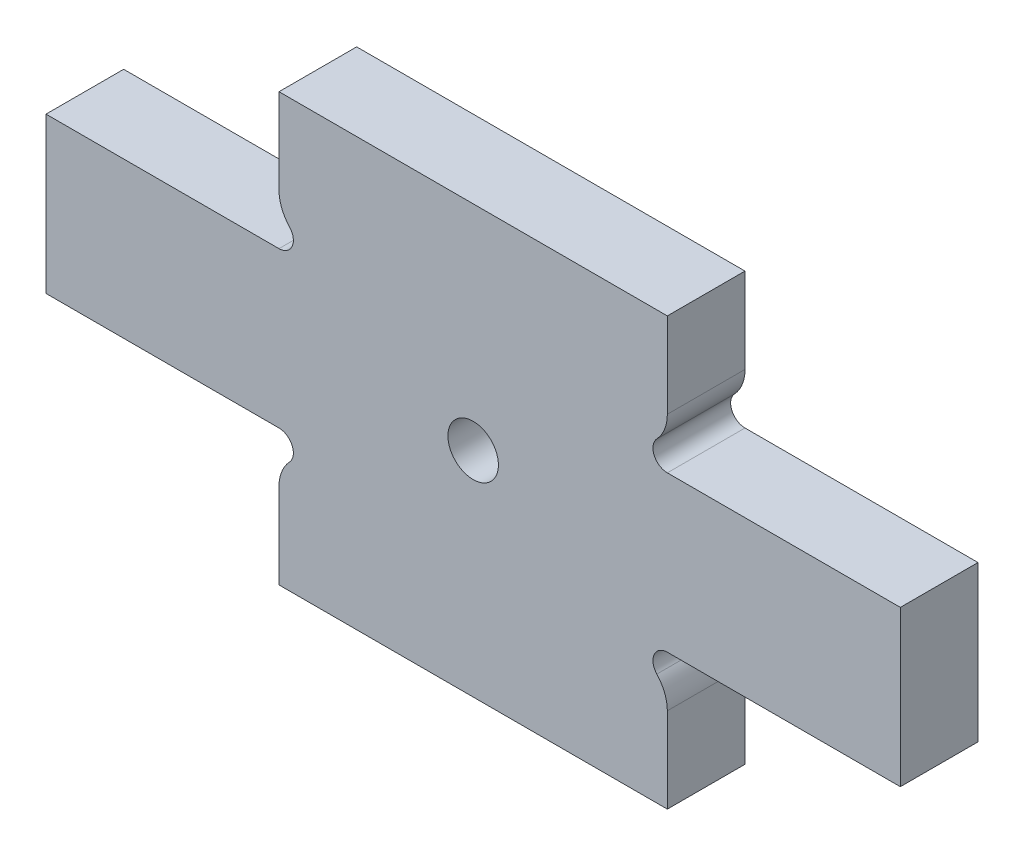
ISO-10303-21;
HEADER;
FILE_DESCRIPTION(('STEP AP214'),'2;1');
FILE_NAME('part.step','',(''),(''),'','','');
FILE_SCHEMA(('AUTOMOTIVE_DESIGN { 1 0 10303 214 1 1 1 1 }'));
ENDSEC;
DATA;
#1=APPLICATION_CONTEXT('core data for automotive mechanical design processes');
#2=APPLICATION_PROTOCOL_DEFINITION('international standard','automotive_design',2000,#1);
#3=PRODUCT_CONTEXT('',#1,'mechanical');
#4=PRODUCT('Part','Part','',(#3));
#5=PRODUCT_RELATED_PRODUCT_CATEGORY('part','',(#4));
#6=PRODUCT_DEFINITION_FORMATION('','',#4);
#7=PRODUCT_DEFINITION_CONTEXT('part definition',#1,'design');
#8=PRODUCT_DEFINITION('design','',#6,#7);
#9=PRODUCT_DEFINITION_SHAPE('','',#8);
#10=(LENGTH_UNIT() NAMED_UNIT(*) SI_UNIT(.MILLI.,.METRE.));
#11=(NAMED_UNIT(*) PLANE_ANGLE_UNIT() SI_UNIT($,.RADIAN.));
#12=(NAMED_UNIT(*) SI_UNIT($,.STERADIAN.) SOLID_ANGLE_UNIT());
#13=UNCERTAINTY_MEASURE_WITH_UNIT(LENGTH_MEASURE(1.E-05),#10,'distance_accuracy_value','');
#14=(GEOMETRIC_REPRESENTATION_CONTEXT(3) GLOBAL_UNCERTAINTY_ASSIGNED_CONTEXT((#13)) GLOBAL_UNIT_ASSIGNED_CONTEXT((#10,
#11,#12)) REPRESENTATION_CONTEXT('',''));
#15=CARTESIAN_POINT('',(0.,0.,0.));
#16=DIRECTION('',(0.,0.,1.));
#17=DIRECTION('',(1.,0.,0.));
#18=AXIS2_PLACEMENT_3D('',#15,#16,#17);
#19=CARTESIAN_POINT('',(20.0000000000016,-16.5321469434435,10.));
#20=DIRECTION('',(0.,0.,-1.));
#21=DIRECTION('',(-1.,0.,0.));
#22=AXIS2_PLACEMENT_3D('',#19,#20,#21);
#23=CYLINDRICAL_SURFACE('',#22,4.99999999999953);
#24=CARTESIAN_POINT('',(20.0000000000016,-16.5321469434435,0.));
#25=DIRECTION('',(0.,0.,1.));
#26=DIRECTION('',(1.,0.,0.));
#27=AXIS2_PLACEMENT_3D('',#24,#25,#26);
#28=CIRCLE('',#27,4.99999999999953);
#29=CARTESIAN_POINT('',(25.0000000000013,-16.5321469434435,0.));
#30=VERTEX_POINT('',#29);
#31=CARTESIAN_POINT('',(23.6496350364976,-13.1145214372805,0.));
#32=VERTEX_POINT('',#31);
#33=EDGE_CURVE('E210',#30,#32,#28,.T.);
#34=ORIENTED_EDGE('',*,*,#33,.T.);
#35=DIRECTION('',(0.,0.,-1.));
#36=VECTOR('',#35,1.);
#37=CARTESIAN_POINT('',(23.6496350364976,-13.1145214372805,10.));
#38=LINE('',#37,#36);
#39=CARTESIAN_POINT('',(23.6496350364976,-13.1145214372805,10.));
#40=VERTEX_POINT('',#39);
#41=EDGE_CURVE('E11',#40,#32,#38,.T.);
#42=ORIENTED_EDGE('',*,*,#41,.F.);
#43=CARTESIAN_POINT('',(20.0000000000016,-16.5321469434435,10.));
#44=DIRECTION('',(0.,0.,1.));
#45=DIRECTION('',(1.,0.,0.));
#46=AXIS2_PLACEMENT_3D('',#43,#44,#45);
#47=CIRCLE('',#46,4.99999999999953);
#48=CARTESIAN_POINT('',(25.0000000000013,-16.5321469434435,10.));
#49=VERTEX_POINT('',#48);
#50=EDGE_CURVE('E249',#49,#40,#47,.T.);
#51=ORIENTED_EDGE('',*,*,#50,.F.);
#52=DIRECTION('',(0.,0.,-1.));
#53=VECTOR('',#52,1.);
#54=CARTESIAN_POINT('',(25.0000000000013,-16.5321469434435,10.));
#55=LINE('',#54,#53);
#56=EDGE_CURVE('E206',#49,#30,#55,.T.);
#57=ORIENTED_EDGE('',*,*,#56,.T.);
#58=EDGE_LOOP('',(#34,#42,#51,#57));
#59=FACE_BOUND('',#58,.T.);
#60=ADVANCED_FACE('F42',(#59),#23,.T.);
#61=CARTESIAN_POINT('',(25.0000000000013,-11.85,10.));
#62=DIRECTION('',(0.,0.,-1.));
#63=DIRECTION('',(-1.,0.,0.));
#64=AXIS2_PLACEMENT_3D('',#61,#62,#63);
#65=CYLINDRICAL_SURFACE('',#64,1.85000000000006);
#66=CARTESIAN_POINT('',(25.0000000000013,-11.85,0.));
#67=DIRECTION('',(0.,0.,-1.));
#68=DIRECTION('',(1.,0.,0.));
#69=AXIS2_PLACEMENT_3D('',#66,#67,#68);
#70=CIRCLE('',#69,1.85000000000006);
#71=CARTESIAN_POINT('',(25.0000000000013,-9.99999999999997,0.));
#72=VERTEX_POINT('',#71);
#73=EDGE_CURVE('E213',#32,#72,#70,.T.);
#74=ORIENTED_EDGE('',*,*,#73,.T.);
#75=DIRECTION('',(0.,0.,-1.));
#76=VECTOR('',#75,1.);
#77=CARTESIAN_POINT('',(25.0000000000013,-9.99999999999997,10.));
#78=LINE('',#77,#76);
#79=CARTESIAN_POINT('',(25.0000000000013,-9.99999999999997,10.));
#80=VERTEX_POINT('',#79);
#81=EDGE_CURVE('E50',#80,#72,#78,.T.);
#82=ORIENTED_EDGE('',*,*,#81,.F.);
#83=CARTESIAN_POINT('',(25.0000000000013,-11.85,10.));
#84=DIRECTION('',(0.,0.,-1.));
#85=DIRECTION('',(1.,0.,0.));
#86=AXIS2_PLACEMENT_3D('',#83,#84,#85);
#87=CIRCLE('',#86,1.85000000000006);
#88=EDGE_CURVE('E137',#40,#80,#87,.T.);
#89=ORIENTED_EDGE('',*,*,#88,.F.);
#90=ORIENTED_EDGE('',*,*,#41,.T.);
#91=EDGE_LOOP('',(#74,#82,#89,#90));
#92=FACE_BOUND('',#91,.T.);
#93=ADVANCED_FACE('F368',(#92),#65,.F.);
#94=CARTESIAN_POINT('',(25.0000000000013,-9.99999999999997,10.));
#95=DIRECTION('',(0.,1.,0.));
#96=DIRECTION('',(-1.,0.,0.));
#97=AXIS2_PLACEMENT_3D('',#94,#95,#96);
#98=PLANE('',#97);
#99=DIRECTION('',(1.,0.,0.));
#100=VECTOR('',#99,1.);
#101=CARTESIAN_POINT('',(25.0000000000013,-9.99999999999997,0.));
#102=LINE('',#101,#100);
#103=CARTESIAN_POINT('',(55.0000000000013,-9.99999999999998,0.));
#104=VERTEX_POINT('',#103);
#105=EDGE_CURVE('E216',#72,#104,#102,.T.);
#106=ORIENTED_EDGE('',*,*,#105,.T.);
#107=DIRECTION('',(0.,0.,-1.));
#108=VECTOR('',#107,1.);
#109=CARTESIAN_POINT('',(55.0000000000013,-9.99999999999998,10.));
#110=LINE('',#109,#108);
#111=CARTESIAN_POINT('',(55.0000000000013,-9.99999999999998,10.));
#112=VERTEX_POINT('',#111);
#113=EDGE_CURVE('E292',#112,#104,#110,.T.);
#114=ORIENTED_EDGE('',*,*,#113,.F.);
#115=DIRECTION('',(1.,0.,0.));
#116=VECTOR('',#115,1.);
#117=CARTESIAN_POINT('',(25.0000000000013,-9.99999999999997,10.));
#118=LINE('',#117,#116);
#119=EDGE_CURVE('E300',#80,#112,#118,.T.);
#120=ORIENTED_EDGE('',*,*,#119,.F.);
#121=ORIENTED_EDGE('',*,*,#81,.T.);
#122=EDGE_LOOP('',(#106,#114,#120,#121));
#123=FACE_BOUND('',#122,.T.);
#124=ADVANCED_FACE('F298',(#123),#98,.F.);
#125=CARTESIAN_POINT('',(55.0000000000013,-9.99999999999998,10.));
#126=DIRECTION('',(-1.,0.,0.));
#127=DIRECTION('',(0.,-1.,0.));
#128=AXIS2_PLACEMENT_3D('',#125,#126,#127);
#129=PLANE('',#128);
#130=DIRECTION('',(0.,1.,0.));
#131=VECTOR('',#130,1.);
#132=CARTESIAN_POINT('',(55.0000000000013,-9.99999999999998,0.));
#133=LINE('',#132,#131);
#134=CARTESIAN_POINT('',(55.0000000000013,10.,0.));
#135=VERTEX_POINT('',#134);
#136=EDGE_CURVE('E218',#104,#135,#133,.T.);
#137=ORIENTED_EDGE('',*,*,#136,.T.);
#138=DIRECTION('',(0.,0.,-1.));
#139=VECTOR('',#138,1.);
#140=CARTESIAN_POINT('',(55.0000000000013,10.,10.));
#141=LINE('',#140,#139);
#142=CARTESIAN_POINT('',(55.0000000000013,10.,10.));
#143=VERTEX_POINT('',#142);
#144=EDGE_CURVE('E289',#143,#135,#141,.T.);
#145=ORIENTED_EDGE('',*,*,#144,.F.);
#146=DIRECTION('',(0.,1.,0.));
#147=VECTOR('',#146,1.);
#148=CARTESIAN_POINT('',(55.0000000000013,-9.99999999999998,10.));
#149=LINE('',#148,#147);
#150=EDGE_CURVE('E318',#112,#143,#149,.T.);
#151=ORIENTED_EDGE('',*,*,#150,.F.);
#152=ORIENTED_EDGE('',*,*,#113,.T.);
#153=EDGE_LOOP('',(#137,#145,#151,#152));
#154=FACE_BOUND('',#153,.T.);
#155=ADVANCED_FACE('F309',(#154),#129,.F.);
#156=CARTESIAN_POINT('',(55.0000000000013,10.,10.));
#157=DIRECTION('',(0.,-1.,0.));
#158=DIRECTION('',(1.,0.,0.));
#159=AXIS2_PLACEMENT_3D('',#156,#157,#158);
#160=PLANE('',#159);
#161=DIRECTION('',(-1.,0.,0.));
#162=VECTOR('',#161,1.);
#163=CARTESIAN_POINT('',(55.0000000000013,10.,0.));
#164=LINE('',#163,#162);
#165=CARTESIAN_POINT('',(25.0000000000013,9.99999999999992,0.));
#166=VERTEX_POINT('',#165);
#167=EDGE_CURVE('E220',#135,#166,#164,.T.);
#168=ORIENTED_EDGE('',*,*,#167,.T.);
#169=DIRECTION('',(0.,0.,-1.));
#170=VECTOR('',#169,1.);
#171=CARTESIAN_POINT('',(25.0000000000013,9.99999999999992,10.));
#172=LINE('',#171,#170);
#173=CARTESIAN_POINT('',(25.0000000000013,9.99999999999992,10.));
#174=VERTEX_POINT('',#173);
#175=EDGE_CURVE('E286',#174,#166,#172,.T.);
#176=ORIENTED_EDGE('',*,*,#175,.F.);
#177=DIRECTION('',(-1.,0.,0.));
#178=VECTOR('',#177,1.);
#179=CARTESIAN_POINT('',(55.0000000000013,10.,10.));
#180=LINE('',#179,#178);
#181=EDGE_CURVE('E315',#143,#174,#180,.T.);
#182=ORIENTED_EDGE('',*,*,#181,.F.);
#183=ORIENTED_EDGE('',*,*,#144,.T.);
#184=EDGE_LOOP('',(#168,#176,#182,#183));
#185=FACE_BOUND('',#184,.T.);
#186=ADVANCED_FACE('F313',(#185),#160,.F.);
#187=CARTESIAN_POINT('',(25.0000000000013,11.85,10.));
#188=DIRECTION('',(0.,0.,-1.));
#189=DIRECTION('',(-1.,0.,0.));
#190=AXIS2_PLACEMENT_3D('',#187,#188,#189);
#191=CYLINDRICAL_SURFACE('',#190,1.85000000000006);
#192=CARTESIAN_POINT('',(25.0000000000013,11.85,0.));
#193=DIRECTION('',(0.,0.,-1.));
#194=DIRECTION('',(1.,0.,0.));
#195=AXIS2_PLACEMENT_3D('',#192,#193,#194);
#196=CIRCLE('',#195,1.85000000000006);
#197=CARTESIAN_POINT('',(23.6496350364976,13.1145214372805,0.));
#198=VERTEX_POINT('',#197);
#199=EDGE_CURVE('E222',#166,#198,#196,.T.);
#200=ORIENTED_EDGE('',*,*,#199,.T.);
#201=DIRECTION('',(0.,0.,-1.));
#202=VECTOR('',#201,1.);
#203=CARTESIAN_POINT('',(23.6496350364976,13.1145214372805,10.));
#204=LINE('',#203,#202);
#205=CARTESIAN_POINT('',(23.6496350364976,13.1145214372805,10.));
#206=VERTEX_POINT('',#205);
#207=EDGE_CURVE('E283',#206,#198,#204,.T.);
#208=ORIENTED_EDGE('',*,*,#207,.F.);
#209=CARTESIAN_POINT('',(25.0000000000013,11.85,10.));
#210=DIRECTION('',(0.,0.,-1.));
#211=DIRECTION('',(1.,0.,0.));
#212=AXIS2_PLACEMENT_3D('',#209,#210,#211);
#213=CIRCLE('',#212,1.85000000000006);
#214=EDGE_CURVE('E317',#174,#206,#213,.T.);
#215=ORIENTED_EDGE('',*,*,#214,.F.);
#216=ORIENTED_EDGE('',*,*,#175,.T.);
#217=EDGE_LOOP('',(#200,#208,#215,#216));
#218=FACE_BOUND('',#217,.T.);
#219=ADVANCED_FACE('F381',(#218),#191,.F.);
#220=CARTESIAN_POINT('',(20.0000000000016,16.5321469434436,10.));
#221=DIRECTION('',(0.,0.,-1.));
#222=DIRECTION('',(-1.,0.,0.));
#223=AXIS2_PLACEMENT_3D('',#220,#221,#222);
#224=CYLINDRICAL_SURFACE('',#223,4.99999999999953);
#225=CARTESIAN_POINT('',(20.0000000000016,16.5321469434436,0.));
#226=DIRECTION('',(0.,0.,1.));
#227=DIRECTION('',(1.,0.,0.));
#228=AXIS2_PLACEMENT_3D('',#225,#226,#227);
#229=CIRCLE('',#228,4.99999999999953);
#230=CARTESIAN_POINT('',(25.0000000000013,16.5321469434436,0.));
#231=VERTEX_POINT('',#230);
#232=EDGE_CURVE('E224',#198,#231,#229,.T.);
#233=ORIENTED_EDGE('',*,*,#232,.T.);
#234=DIRECTION('',(0.,0.,-1.));
#235=VECTOR('',#234,1.);
#236=CARTESIAN_POINT('',(25.0000000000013,16.5321469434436,10.));
#237=LINE('',#236,#235);
#238=CARTESIAN_POINT('',(25.0000000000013,16.5321469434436,10.));
#239=VERTEX_POINT('',#238);
#240=EDGE_CURVE('E280',#239,#231,#237,.T.);
#241=ORIENTED_EDGE('',*,*,#240,.F.);
#242=CARTESIAN_POINT('',(20.0000000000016,16.5321469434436,10.));
#243=DIRECTION('',(0.,0.,1.));
#244=DIRECTION('',(1.,0.,0.));
#245=AXIS2_PLACEMENT_3D('',#242,#243,#244);
#246=CIRCLE('',#245,4.99999999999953);
#247=EDGE_CURVE('E320',#206,#239,#246,.T.);
#248=ORIENTED_EDGE('',*,*,#247,.F.);
#249=ORIENTED_EDGE('',*,*,#207,.T.);
#250=EDGE_LOOP('',(#233,#241,#248,#249));
#251=FACE_BOUND('',#250,.T.);
#252=ADVANCED_FACE('F384',(#251),#224,.T.);
#253=CARTESIAN_POINT('',(25.0000000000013,16.5321469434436,10.));
#254=DIRECTION('',(-1.,0.,0.));
#255=DIRECTION('',(0.,0.,1.));
#256=AXIS2_PLACEMENT_3D('',#253,#254,#255);
#257=PLANE('',#256);
#258=DIRECTION('',(0.,1.,0.));
#259=VECTOR('',#258,1.);
#260=CARTESIAN_POINT('',(25.0000000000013,16.5321469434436,0.));
#261=LINE('',#260,#259);
#262=CARTESIAN_POINT('',(25.0000000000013,27.5,0.));
#263=VERTEX_POINT('',#262);
#264=EDGE_CURVE('E226',#231,#263,#261,.T.);
#265=ORIENTED_EDGE('',*,*,#264,.T.);
#266=DIRECTION('',(0.,0.,-1.));
#267=VECTOR('',#266,1.);
#268=CARTESIAN_POINT('',(25.0000000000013,27.5,10.));
#269=LINE('',#268,#267);
#270=CARTESIAN_POINT('',(25.0000000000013,27.5,10.));
#271=VERTEX_POINT('',#270);
#272=EDGE_CURVE('E277',#271,#263,#269,.T.);
#273=ORIENTED_EDGE('',*,*,#272,.F.);
#274=DIRECTION('',(0.,1.,0.));
#275=VECTOR('',#274,1.);
#276=CARTESIAN_POINT('',(25.0000000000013,16.5321469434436,10.));
#277=LINE('',#276,#275);
#278=EDGE_CURVE('E326',#239,#271,#277,.T.);
#279=ORIENTED_EDGE('',*,*,#278,.F.);
#280=ORIENTED_EDGE('',*,*,#240,.T.);
#281=EDGE_LOOP('',(#265,#273,#279,#280));
#282=FACE_BOUND('',#281,.T.);
#283=ADVANCED_FACE('F388',(#282),#257,.F.);
#284=CARTESIAN_POINT('',(25.0000000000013,27.5,10.));
#285=DIRECTION('',(0.,-1.,0.));
#286=DIRECTION('',(0.,0.,-1.));
#287=AXIS2_PLACEMENT_3D('',#284,#285,#286);
#288=PLANE('',#287);
#289=DIRECTION('',(-1.,0.,0.));
#290=VECTOR('',#289,1.);
#291=CARTESIAN_POINT('',(25.0000000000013,27.5,0.));
#292=LINE('',#291,#290);
#293=CARTESIAN_POINT('',(-25.,27.5,0.));
#294=VERTEX_POINT('',#293);
#295=EDGE_CURVE('E228',#263,#294,#292,.T.);
#296=ORIENTED_EDGE('',*,*,#295,.T.);
#297=DIRECTION('',(0.,0.,-1.));
#298=VECTOR('',#297,1.);
#299=CARTESIAN_POINT('',(-25.,27.5,10.));
#300=LINE('',#299,#298);
#301=CARTESIAN_POINT('',(-25.,27.5,10.));
#302=VERTEX_POINT('',#301);
#303=EDGE_CURVE('E274',#302,#294,#300,.T.);
#304=ORIENTED_EDGE('',*,*,#303,.F.);
#305=DIRECTION('',(-1.,0.,0.));
#306=VECTOR('',#305,1.);
#307=CARTESIAN_POINT('',(25.0000000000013,27.5,10.));
#308=LINE('',#307,#306);
#309=EDGE_CURVE('E328',#271,#302,#308,.T.);
#310=ORIENTED_EDGE('',*,*,#309,.F.);
#311=ORIENTED_EDGE('',*,*,#272,.T.);
#312=EDGE_LOOP('',(#296,#304,#310,#311));
#313=FACE_BOUND('',#312,.T.);
#314=ADVANCED_FACE('F392',(#313),#288,.F.);
#315=CARTESIAN_POINT('',(-25.,27.5,10.));
#316=DIRECTION('',(1.,0.,0.));
#317=DIRECTION('',(0.,0.,-1.));
#318=AXIS2_PLACEMENT_3D('',#315,#316,#317);
#319=PLANE('',#318);
#320=DIRECTION('',(0.,-1.,0.));
#321=VECTOR('',#320,1.);
#322=CARTESIAN_POINT('',(-25.,27.5,0.));
#323=LINE('',#322,#321);
#324=CARTESIAN_POINT('',(-24.9999999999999,16.5321469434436,0.));
#325=VERTEX_POINT('',#324);
#326=EDGE_CURVE('E230',#294,#325,#323,.T.);
#327=ORIENTED_EDGE('',*,*,#326,.T.);
#328=DIRECTION('',(0.,0.,-1.));
#329=VECTOR('',#328,1.);
#330=CARTESIAN_POINT('',(-24.9999999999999,16.5321469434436,10.));
#331=LINE('',#330,#329);
#332=CARTESIAN_POINT('',(-24.9999999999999,16.5321469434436,10.));
#333=VERTEX_POINT('',#332);
#334=EDGE_CURVE('E271',#333,#325,#331,.T.);
#335=ORIENTED_EDGE('',*,*,#334,.F.);
#336=DIRECTION('',(0.,-1.,0.));
#337=VECTOR('',#336,1.);
#338=CARTESIAN_POINT('',(-25.,27.5,10.));
#339=LINE('',#338,#337);
#340=EDGE_CURVE('E330',#302,#333,#339,.T.);
#341=ORIENTED_EDGE('',*,*,#340,.F.);
#342=ORIENTED_EDGE('',*,*,#303,.T.);
#343=EDGE_LOOP('',(#327,#335,#341,#342));
#344=FACE_BOUND('',#343,.T.);
#345=ADVANCED_FACE('F396',(#344),#319,.F.);
#346=CARTESIAN_POINT('',(-20.0000000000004,16.5321469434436,10.));
#347=DIRECTION('',(0.,0.,-1.));
#348=DIRECTION('',(-1.,0.,0.));
#349=AXIS2_PLACEMENT_3D('',#346,#347,#348);
#350=CYLINDRICAL_SURFACE('',#349,4.99999999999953);
#351=CARTESIAN_POINT('',(-20.0000000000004,16.5321469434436,0.));
#352=DIRECTION('',(0.,0.,1.));
#353=DIRECTION('',(1.,0.,0.));
#354=AXIS2_PLACEMENT_3D('',#351,#352,#353);
#355=CIRCLE('',#354,4.99999999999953);
#356=CARTESIAN_POINT('',(-23.6496350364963,13.1145214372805,0.));
#357=VERTEX_POINT('',#356);
#358=EDGE_CURVE('E232',#325,#357,#355,.T.);
#359=ORIENTED_EDGE('',*,*,#358,.T.);
#360=DIRECTION('',(0.,0.,-1.));
#361=VECTOR('',#360,1.);
#362=CARTESIAN_POINT('',(-23.6496350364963,13.1145214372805,10.));
#363=LINE('',#362,#361);
#364=CARTESIAN_POINT('',(-23.6496350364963,13.1145214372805,10.));
#365=VERTEX_POINT('',#364);
#366=EDGE_CURVE('E268',#365,#357,#363,.T.);
#367=ORIENTED_EDGE('',*,*,#366,.F.);
#368=CARTESIAN_POINT('',(-20.0000000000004,16.5321469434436,10.));
#369=DIRECTION('',(0.,0.,1.));
#370=DIRECTION('',(1.,0.,0.));
#371=AXIS2_PLACEMENT_3D('',#368,#369,#370);
#372=CIRCLE('',#371,4.99999999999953);
#373=EDGE_CURVE('E332',#333,#365,#372,.T.);
#374=ORIENTED_EDGE('',*,*,#373,.F.);
#375=ORIENTED_EDGE('',*,*,#334,.T.);
#376=EDGE_LOOP('',(#359,#367,#374,#375));
#377=FACE_BOUND('',#376,.T.);
#378=ADVANCED_FACE('F400',(#377),#350,.T.);
#379=CARTESIAN_POINT('',(-25.,11.85,10.));
#380=DIRECTION('',(0.,0.,-1.));
#381=DIRECTION('',(-1.,0.,0.));
#382=AXIS2_PLACEMENT_3D('',#379,#380,#381);
#383=CYLINDRICAL_SURFACE('',#382,1.85000000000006);
#384=CARTESIAN_POINT('',(-25.,11.85,0.));
#385=DIRECTION('',(0.,0.,-1.));
#386=DIRECTION('',(1.,0.,0.));
#387=AXIS2_PLACEMENT_3D('',#384,#385,#386);
#388=CIRCLE('',#387,1.85000000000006);
#389=CARTESIAN_POINT('',(-25.,10.,0.));
#390=VERTEX_POINT('',#389);
#391=EDGE_CURVE('E234',#357,#390,#388,.T.);
#392=ORIENTED_EDGE('',*,*,#391,.T.);
#393=DIRECTION('',(0.,0.,-1.));
#394=VECTOR('',#393,1.);
#395=CARTESIAN_POINT('',(-25.,10.,10.));
#396=LINE('',#395,#394);
#397=CARTESIAN_POINT('',(-25.,10.,10.));
#398=VERTEX_POINT('',#397);
#399=EDGE_CURVE('E265',#398,#390,#396,.T.);
#400=ORIENTED_EDGE('',*,*,#399,.F.);
#401=CARTESIAN_POINT('',(-25.,11.85,10.));
#402=DIRECTION('',(0.,0.,-1.));
#403=DIRECTION('',(1.,0.,0.));
#404=AXIS2_PLACEMENT_3D('',#401,#402,#403);
#405=CIRCLE('',#404,1.85000000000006);
#406=EDGE_CURVE('E334',#365,#398,#405,.T.);
#407=ORIENTED_EDGE('',*,*,#406,.F.);
#408=ORIENTED_EDGE('',*,*,#366,.T.);
#409=EDGE_LOOP('',(#392,#400,#407,#408));
#410=FACE_BOUND('',#409,.T.);
#411=ADVANCED_FACE('F404',(#410),#383,.F.);
#412=CARTESIAN_POINT('',(-25.,10.,10.));
#413=DIRECTION('',(0.,-1.,0.));
#414=DIRECTION('',(1.,0.,0.));
#415=AXIS2_PLACEMENT_3D('',#412,#413,#414);
#416=PLANE('',#415);
#417=DIRECTION('',(-1.,0.,0.));
#418=VECTOR('',#417,1.);
#419=CARTESIAN_POINT('',(-25.,10.,0.));
#420=LINE('',#419,#418);
#421=CARTESIAN_POINT('',(-55.,10.,0.));
#422=VERTEX_POINT('',#421);
#423=EDGE_CURVE('E236',#390,#422,#420,.T.);
#424=ORIENTED_EDGE('',*,*,#423,.T.);
#425=DIRECTION('',(0.,0.,-1.));
#426=VECTOR('',#425,1.);
#427=CARTESIAN_POINT('',(-55.,10.,10.));
#428=LINE('',#427,#426);
#429=CARTESIAN_POINT('',(-55.,10.,10.));
#430=VERTEX_POINT('',#429);
#431=EDGE_CURVE('E262',#430,#422,#428,.T.);
#432=ORIENTED_EDGE('',*,*,#431,.F.);
#433=DIRECTION('',(-1.,0.,0.));
#434=VECTOR('',#433,1.);
#435=CARTESIAN_POINT('',(-25.,10.,10.));
#436=LINE('',#435,#434);
#437=EDGE_CURVE('E336',#398,#430,#436,.T.);
#438=ORIENTED_EDGE('',*,*,#437,.F.);
#439=ORIENTED_EDGE('',*,*,#399,.T.);
#440=EDGE_LOOP('',(#424,#432,#438,#439));
#441=FACE_BOUND('',#440,.T.);
#442=ADVANCED_FACE('F408',(#441),#416,.F.);
#443=CARTESIAN_POINT('',(-55.,10.,10.));
#444=DIRECTION('',(1.,0.,0.));
#445=DIRECTION('',(0.,0.,-1.));
#446=AXIS2_PLACEMENT_3D('',#443,#444,#445);
#447=PLANE('',#446);
#448=DIRECTION('',(0.,-1.,0.));
#449=VECTOR('',#448,1.);
#450=CARTESIAN_POINT('',(-55.,10.,0.));
#451=LINE('',#450,#449);
#452=CARTESIAN_POINT('',(-55.,-9.99999999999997,0.));
#453=VERTEX_POINT('',#452);
#454=EDGE_CURVE('E238',#422,#453,#451,.T.);
#455=ORIENTED_EDGE('',*,*,#454,.T.);
#456=DIRECTION('',(0.,0.,-1.));
#457=VECTOR('',#456,1.);
#458=CARTESIAN_POINT('',(-55.,-9.99999999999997,10.));
#459=LINE('',#458,#457);
#460=CARTESIAN_POINT('',(-55.,-9.99999999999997,10.));
#461=VERTEX_POINT('',#460);
#462=EDGE_CURVE('E259',#461,#453,#459,.T.);
#463=ORIENTED_EDGE('',*,*,#462,.F.);
#464=DIRECTION('',(0.,-1.,0.));
#465=VECTOR('',#464,1.);
#466=CARTESIAN_POINT('',(-55.,10.,10.));
#467=LINE('',#466,#465);
#468=EDGE_CURVE('E338',#430,#461,#467,.T.);
#469=ORIENTED_EDGE('',*,*,#468,.F.);
#470=ORIENTED_EDGE('',*,*,#431,.T.);
#471=EDGE_LOOP('',(#455,#463,#469,#470));
#472=FACE_BOUND('',#471,.T.);
#473=ADVANCED_FACE('F412',(#472),#447,.F.);
#474=CARTESIAN_POINT('',(-55.,-9.99999999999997,10.));
#475=DIRECTION('',(0.,1.,0.));
#476=DIRECTION('',(0.,0.,1.));
#477=AXIS2_PLACEMENT_3D('',#474,#475,#476);
#478=PLANE('',#477);
#479=DIRECTION('',(1.,0.,0.));
#480=VECTOR('',#479,1.);
#481=CARTESIAN_POINT('',(-55.,-9.99999999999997,0.));
#482=LINE('',#481,#480);
#483=CARTESIAN_POINT('',(-25.,-9.9999999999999,0.));
#484=VERTEX_POINT('',#483);
#485=EDGE_CURVE('E240',#453,#484,#482,.T.);
#486=ORIENTED_EDGE('',*,*,#485,.T.);
#487=DIRECTION('',(0.,0.,-1.));
#488=VECTOR('',#487,1.);
#489=CARTESIAN_POINT('',(-25.,-9.9999999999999,10.));
#490=LINE('',#489,#488);
#491=CARTESIAN_POINT('',(-25.,-9.9999999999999,10.));
#492=VERTEX_POINT('',#491);
#493=EDGE_CURVE('E256',#492,#484,#490,.T.);
#494=ORIENTED_EDGE('',*,*,#493,.F.);
#495=DIRECTION('',(1.,0.,0.));
#496=VECTOR('',#495,1.);
#497=CARTESIAN_POINT('',(-55.,-9.99999999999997,10.));
#498=LINE('',#497,#496);
#499=EDGE_CURVE('E340',#461,#492,#498,.T.);
#500=ORIENTED_EDGE('',*,*,#499,.F.);
#501=ORIENTED_EDGE('',*,*,#462,.T.);
#502=EDGE_LOOP('',(#486,#494,#500,#501));
#503=FACE_BOUND('',#502,.T.);
#504=ADVANCED_FACE('F416',(#503),#478,.F.);
#505=CARTESIAN_POINT('',(-25.,-11.85,10.));
#506=DIRECTION('',(0.,0.,-1.));
#507=DIRECTION('',(-1.,0.,0.));
#508=AXIS2_PLACEMENT_3D('',#505,#506,#507);
#509=CYLINDRICAL_SURFACE('',#508,1.85000000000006);
#510=CARTESIAN_POINT('',(-25.,-11.85,0.));
#511=DIRECTION('',(0.,0.,-1.));
#512=DIRECTION('',(1.,0.,0.));
#513=AXIS2_PLACEMENT_3D('',#510,#511,#512);
#514=CIRCLE('',#513,1.85000000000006);
#515=CARTESIAN_POINT('',(-23.6496350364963,-13.1145214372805,0.));
#516=VERTEX_POINT('',#515);
#517=EDGE_CURVE('E242',#484,#516,#514,.T.);
#518=ORIENTED_EDGE('',*,*,#517,.T.);
#519=DIRECTION('',(0.,0.,-1.));
#520=VECTOR('',#519,1.);
#521=CARTESIAN_POINT('',(-23.6496350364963,-13.1145214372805,10.));
#522=LINE('',#521,#520);
#523=CARTESIAN_POINT('',(-23.6496350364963,-13.1145214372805,10.));
#524=VERTEX_POINT('',#523);
#525=EDGE_CURVE('E253',#524,#516,#522,.T.);
#526=ORIENTED_EDGE('',*,*,#525,.F.);
#527=CARTESIAN_POINT('',(-25.,-11.85,10.));
#528=DIRECTION('',(0.,0.,-1.));
#529=DIRECTION('',(1.,0.,0.));
#530=AXIS2_PLACEMENT_3D('',#527,#528,#529);
#531=CIRCLE('',#530,1.85000000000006);
#532=EDGE_CURVE('E342',#492,#524,#531,.T.);
#533=ORIENTED_EDGE('',*,*,#532,.F.);
#534=ORIENTED_EDGE('',*,*,#493,.T.);
#535=EDGE_LOOP('',(#518,#526,#533,#534));
#536=FACE_BOUND('',#535,.T.);
#537=ADVANCED_FACE('F348',(#536),#509,.F.);
#538=CARTESIAN_POINT('',(-20.0000000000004,-16.5321469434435,10.));
#539=DIRECTION('',(0.,0.,-1.));
#540=DIRECTION('',(-1.,0.,0.));
#541=AXIS2_PLACEMENT_3D('',#538,#539,#540);
#542=CYLINDRICAL_SURFACE('',#541,4.99999999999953);
#543=CARTESIAN_POINT('',(-20.0000000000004,-16.5321469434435,0.));
#544=DIRECTION('',(0.,0.,1.));
#545=DIRECTION('',(1.,0.,0.));
#546=AXIS2_PLACEMENT_3D('',#543,#544,#545);
#547=CIRCLE('',#546,4.99999999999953);
#548=CARTESIAN_POINT('',(-25.,-16.5321469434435,0.));
#549=VERTEX_POINT('',#548);
#550=EDGE_CURVE('E244',#516,#549,#547,.T.);
#551=ORIENTED_EDGE('',*,*,#550,.T.);
#552=DIRECTION('',(0.,0.,-1.));
#553=VECTOR('',#552,1.);
#554=CARTESIAN_POINT('',(-25.,-16.5321469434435,10.));
#555=LINE('',#554,#553);
#556=CARTESIAN_POINT('',(-25.,-16.5321469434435,10.));
#557=VERTEX_POINT('',#556);
#558=EDGE_CURVE('E201',#557,#549,#555,.T.);
#559=ORIENTED_EDGE('',*,*,#558,.F.);
#560=CARTESIAN_POINT('',(-20.0000000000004,-16.5321469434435,10.));
#561=DIRECTION('',(0.,0.,1.));
#562=DIRECTION('',(1.,0.,0.));
#563=AXIS2_PLACEMENT_3D('',#560,#561,#562);
#564=CIRCLE('',#563,4.99999999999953);
#565=EDGE_CURVE('E192',#524,#557,#564,.T.);
#566=ORIENTED_EDGE('',*,*,#565,.F.);
#567=ORIENTED_EDGE('',*,*,#525,.T.);
#568=EDGE_LOOP('',(#551,#559,#566,#567));
#569=FACE_BOUND('',#568,.T.);
#570=ADVANCED_FACE('F352',(#569),#542,.T.);
#571=CARTESIAN_POINT('',(-25.,-16.5321469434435,10.));
#572=DIRECTION('',(1.,0.,0.));
#573=DIRECTION('',(0.,0.,-1.));
#574=AXIS2_PLACEMENT_3D('',#571,#572,#573);
#575=PLANE('',#574);
#576=DIRECTION('',(0.,-1.,0.));
#577=VECTOR('',#576,1.);
#578=CARTESIAN_POINT('',(-25.,-16.5321469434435,0.));
#579=LINE('',#578,#577);
#580=CARTESIAN_POINT('',(-25.,-27.5,0.));
#581=VERTEX_POINT('',#580);
#582=EDGE_CURVE('E200',#549,#581,#579,.T.);
#583=ORIENTED_EDGE('',*,*,#582,.T.);
#584=DIRECTION('',(0.,0.,-1.));
#585=VECTOR('',#584,1.);
#586=CARTESIAN_POINT('',(-25.,-27.5,10.));
#587=LINE('',#586,#585);
#588=CARTESIAN_POINT('',(-25.,-27.5,10.));
#589=VERTEX_POINT('',#588);
#590=EDGE_CURVE('E197',#589,#581,#587,.T.);
#591=ORIENTED_EDGE('',*,*,#590,.F.);
#592=DIRECTION('',(0.,-1.,0.));
#593=VECTOR('',#592,1.);
#594=CARTESIAN_POINT('',(-25.,-16.5321469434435,10.));
#595=LINE('',#594,#593);
#596=EDGE_CURVE('E186',#557,#589,#595,.T.);
#597=ORIENTED_EDGE('',*,*,#596,.F.);
#598=ORIENTED_EDGE('',*,*,#558,.T.);
#599=EDGE_LOOP('',(#583,#591,#597,#598));
#600=FACE_BOUND('',#599,.T.);
#601=ADVANCED_FACE('F198',(#600),#575,.F.);
#602=CARTESIAN_POINT('',(-25.,-27.5,10.));
#603=DIRECTION('',(0.,1.,0.));
#604=DIRECTION('',(0.,0.,1.));
#605=AXIS2_PLACEMENT_3D('',#602,#603,#604);
#606=PLANE('',#605);
#607=DIRECTION('',(1.,0.,0.));
#608=VECTOR('',#607,1.);
#609=CARTESIAN_POINT('',(-25.,-27.5,0.));
#610=LINE('',#609,#608);
#611=CARTESIAN_POINT('',(25.0000000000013,-27.5,0.));
#612=VERTEX_POINT('',#611);
#613=EDGE_CURVE('E123',#581,#612,#610,.T.);
#614=ORIENTED_EDGE('',*,*,#613,.T.);
#615=DIRECTION('',(0.,0.,-1.));
#616=VECTOR('',#615,1.);
#617=CARTESIAN_POINT('',(25.0000000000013,-27.5,10.));
#618=LINE('',#617,#616);
#619=CARTESIAN_POINT('',(25.0000000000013,-27.5,10.));
#620=VERTEX_POINT('',#619);
#621=EDGE_CURVE('E202',#620,#612,#618,.T.);
#622=ORIENTED_EDGE('',*,*,#621,.F.);
#623=DIRECTION('',(1.,0.,0.));
#624=VECTOR('',#623,1.);
#625=CARTESIAN_POINT('',(-25.,-27.5,10.));
#626=LINE('',#625,#624);
#627=EDGE_CURVE('E190',#589,#620,#626,.T.);
#628=ORIENTED_EDGE('',*,*,#627,.F.);
#629=ORIENTED_EDGE('',*,*,#590,.T.);
#630=EDGE_LOOP('',(#614,#622,#628,#629));
#631=FACE_BOUND('',#630,.T.);
#632=ADVANCED_FACE('F204',(#631),#606,.F.);
#633=CARTESIAN_POINT('',(25.0000000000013,-27.5,10.));
#634=DIRECTION('',(-1.,0.,0.));
#635=DIRECTION('',(0.,0.,1.));
#636=AXIS2_PLACEMENT_3D('',#633,#634,#635);
#637=PLANE('',#636);
#638=DIRECTION('',(0.,1.,0.));
#639=VECTOR('',#638,1.);
#640=CARTESIAN_POINT('',(25.0000000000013,-27.5,0.));
#641=LINE('',#640,#639);
#642=EDGE_CURVE('E129',#612,#30,#641,.T.);
#643=ORIENTED_EDGE('',*,*,#642,.T.);
#644=ORIENTED_EDGE('',*,*,#56,.F.);
#645=DIRECTION('',(0.,1.,0.));
#646=VECTOR('',#645,1.);
#647=CARTESIAN_POINT('',(25.0000000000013,-27.5,10.));
#648=LINE('',#647,#646);
#649=EDGE_CURVE('E58',#620,#49,#648,.T.);
#650=ORIENTED_EDGE('',*,*,#649,.F.);
#651=ORIENTED_EDGE('',*,*,#621,.T.);
#652=EDGE_LOOP('',(#643,#644,#650,#651));
#653=FACE_BOUND('',#652,.T.);
#654=ADVANCED_FACE('F356',(#653),#637,.F.);
#655=CARTESIAN_POINT('',(20.0000000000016,-16.5321469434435,10.));
#656=DIRECTION('',(0.,0.,1.));
#657=DIRECTION('',(1.,0.,0.));
#658=AXIS2_PLACEMENT_3D('',#655,#656,#657);
#659=PLANE('',#658);
#660=CARTESIAN_POINT('',(0.,0.,10.));
#661=DIRECTION('',(0.,0.,1.));
#662=DIRECTION('',(1.,0.,0.));
#663=AXIS2_PLACEMENT_3D('',#660,#661,#662);
#664=CIRCLE('',#663,3.25);
#665=CARTESIAN_POINT('',(3.25,0.,10.));
#666=VERTEX_POINT('',#665);
#667=EDGE_CURVE('E472',#666,#666,#664,.T.);
#668=ORIENTED_EDGE('',*,*,#667,.F.);
#669=EDGE_LOOP('',(#668));
#670=FACE_BOUND('',#669,.T.);
#671=ORIENTED_EDGE('',*,*,#50,.T.);
#672=ORIENTED_EDGE('',*,*,#88,.T.);
#673=ORIENTED_EDGE('',*,*,#119,.T.);
#674=ORIENTED_EDGE('',*,*,#150,.T.);
#675=ORIENTED_EDGE('',*,*,#181,.T.);
#676=ORIENTED_EDGE('',*,*,#214,.T.);
#677=ORIENTED_EDGE('',*,*,#247,.T.);
#678=ORIENTED_EDGE('',*,*,#278,.T.);
#679=ORIENTED_EDGE('',*,*,#309,.T.);
#680=ORIENTED_EDGE('',*,*,#340,.T.);
#681=ORIENTED_EDGE('',*,*,#373,.T.);
#682=ORIENTED_EDGE('',*,*,#406,.T.);
#683=ORIENTED_EDGE('',*,*,#437,.T.);
#684=ORIENTED_EDGE('',*,*,#468,.T.);
#685=ORIENTED_EDGE('',*,*,#499,.T.);
#686=ORIENTED_EDGE('',*,*,#532,.T.);
#687=ORIENTED_EDGE('',*,*,#565,.T.);
#688=ORIENTED_EDGE('',*,*,#596,.T.);
#689=ORIENTED_EDGE('',*,*,#627,.T.);
#690=ORIENTED_EDGE('',*,*,#649,.T.);
#691=EDGE_LOOP('',(#671,#672,#673,#674,#675,#676,#677,#678,#679,#680,#681,#682,#683,#684,#685,
#686,#687,#688,#689,#690));
#692=FACE_BOUND('',#691,.T.);
#693=ADVANCED_FACE('F188',(#670,#692),#659,.T.);
#694=CARTESIAN_POINT('',(20.0000000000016,-16.5321469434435,0.));
#695=DIRECTION('',(0.,0.,1.));
#696=DIRECTION('',(1.,0.,0.));
#697=AXIS2_PLACEMENT_3D('',#694,#695,#696);
#698=PLANE('',#697);
#699=CARTESIAN_POINT('',(0.,0.,0.));
#700=DIRECTION('',(0.,0.,1.));
#701=DIRECTION('',(1.,0.,0.));
#702=AXIS2_PLACEMENT_3D('',#699,#700,#701);
#703=CIRCLE('',#702,3.25);
#704=CARTESIAN_POINT('',(3.25,0.,0.));
#705=VERTEX_POINT('',#704);
#706=EDGE_CURVE('E214',#705,#705,#703,.T.);
#707=ORIENTED_EDGE('',*,*,#706,.T.);
#708=EDGE_LOOP('',(#707));
#709=FACE_BOUND('',#708,.T.);
#710=ORIENTED_EDGE('',*,*,#33,.F.);
#711=ORIENTED_EDGE('',*,*,#642,.F.);
#712=ORIENTED_EDGE('',*,*,#613,.F.);
#713=ORIENTED_EDGE('',*,*,#582,.F.);
#714=ORIENTED_EDGE('',*,*,#550,.F.);
#715=ORIENTED_EDGE('',*,*,#517,.F.);
#716=ORIENTED_EDGE('',*,*,#485,.F.);
#717=ORIENTED_EDGE('',*,*,#454,.F.);
#718=ORIENTED_EDGE('',*,*,#423,.F.);
#719=ORIENTED_EDGE('',*,*,#391,.F.);
#720=ORIENTED_EDGE('',*,*,#358,.F.);
#721=ORIENTED_EDGE('',*,*,#326,.F.);
#722=ORIENTED_EDGE('',*,*,#295,.F.);
#723=ORIENTED_EDGE('',*,*,#264,.F.);
#724=ORIENTED_EDGE('',*,*,#232,.F.);
#725=ORIENTED_EDGE('',*,*,#199,.F.);
#726=ORIENTED_EDGE('',*,*,#167,.F.);
#727=ORIENTED_EDGE('',*,*,#136,.F.);
#728=ORIENTED_EDGE('',*,*,#105,.F.);
#729=ORIENTED_EDGE('',*,*,#73,.F.);
#730=EDGE_LOOP('',(#710,#711,#712,#713,#714,#715,#716,#717,#718,#719,#720,#721,#722,#723,#724,
#725,#726,#727,#728,#729));
#731=FACE_BOUND('',#730,.T.);
#732=ADVANCED_FACE('F304',(#709,#731),#698,.F.);
#733=CARTESIAN_POINT('',(0.,0.,0.));
#734=DIRECTION('',(0.,0.,1.));
#735=DIRECTION('',(1.,0.,0.));
#736=AXIS2_PLACEMENT_3D('',#733,#734,#735);
#737=CYLINDRICAL_SURFACE('',#736,3.25);
#738=ORIENTED_EDGE('',*,*,#706,.F.);
#739=EDGE_LOOP('',(#738));
#740=FACE_BOUND('',#739,.T.);
#741=ORIENTED_EDGE('',*,*,#667,.T.);
#742=EDGE_LOOP('',(#741));
#743=FACE_BOUND('',#742,.T.);
#744=ADVANCED_FACE('F455',(#740,#743),#737,.F.);
#745=CLOSED_SHELL('',(#60,#93,#124,#155,#186,#219,#252,#283,#314,#345,#378,#411,#442,#473,#504,
#537,#570,#601,#632,#654,#693,#732,#744));
#746=MANIFOLD_SOLID_BREP('B2',#745);
#747=ADVANCED_BREP_SHAPE_REPRESENTATION('',(#18,#746),#14);
#748=SHAPE_DEFINITION_REPRESENTATION(#9,#747);
ENDSEC;
END-ISO-10303-21;
